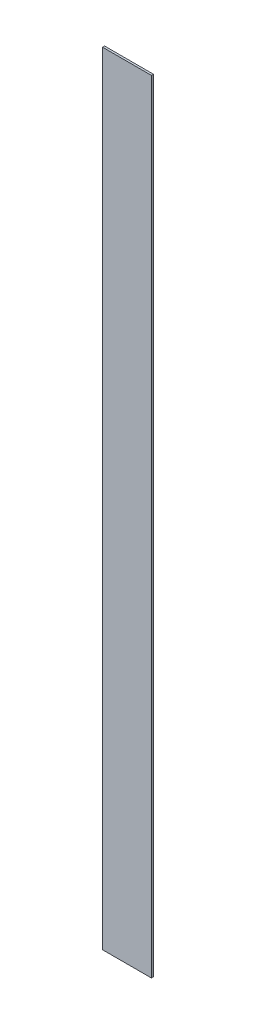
ISO-10303-21;
HEADER;
FILE_DESCRIPTION(('STEP AP214'),'2;1');
FILE_NAME('part.step','',(''),(''),'','','');
FILE_SCHEMA(('AUTOMOTIVE_DESIGN { 1 0 10303 214 1 1 1 1 }'));
ENDSEC;
DATA;
#1=APPLICATION_CONTEXT('core data for automotive mechanical design processes');
#2=APPLICATION_PROTOCOL_DEFINITION('international standard','automotive_design',2000,#1);
#3=PRODUCT_CONTEXT('',#1,'mechanical');
#4=PRODUCT('Part','Part','',(#3));
#5=PRODUCT_RELATED_PRODUCT_CATEGORY('part','',(#4));
#6=PRODUCT_DEFINITION_FORMATION('','',#4);
#7=PRODUCT_DEFINITION_CONTEXT('part definition',#1,'design');
#8=PRODUCT_DEFINITION('design','',#6,#7);
#9=PRODUCT_DEFINITION_SHAPE('','',#8);
#10=(LENGTH_UNIT() NAMED_UNIT(*) SI_UNIT(.MILLI.,.METRE.));
#11=(NAMED_UNIT(*) PLANE_ANGLE_UNIT() SI_UNIT($,.RADIAN.));
#12=(NAMED_UNIT(*) SI_UNIT($,.STERADIAN.) SOLID_ANGLE_UNIT());
#13=UNCERTAINTY_MEASURE_WITH_UNIT(LENGTH_MEASURE(1.E-05),#10,'distance_accuracy_value','');
#14=(GEOMETRIC_REPRESENTATION_CONTEXT(3) GLOBAL_UNCERTAINTY_ASSIGNED_CONTEXT((#13)) GLOBAL_UNIT_ASSIGNED_CONTEXT((#10,
#11,#12)) REPRESENTATION_CONTEXT('',''));
#15=CARTESIAN_POINT('',(0.,0.,0.));
#16=DIRECTION('',(0.,0.,1.));
#17=DIRECTION('',(1.,0.,0.));
#18=AXIS2_PLACEMENT_3D('',#15,#16,#17);
#19=CARTESIAN_POINT('',(-38.1,609.6,1.5875));
#20=DIRECTION('',(0.,-1.,0.));
#21=DIRECTION('',(0.,0.,-1.));
#22=AXIS2_PLACEMENT_3D('',#19,#20,#21);
#23=PLANE('',#22);
#24=DIRECTION('',(-1.,0.,0.));
#25=VECTOR('',#24,1.);
#26=CARTESIAN_POINT('',(-38.1,609.6,-1.5875));
#27=LINE('',#26,#25);
#28=CARTESIAN_POINT('',(38.1,609.6,-1.5875));
#29=VERTEX_POINT('',#28);
#30=CARTESIAN_POINT('',(-38.1,609.6,-1.5875));
#31=VERTEX_POINT('',#30);
#32=EDGE_CURVE('E111',#29,#31,#27,.T.);
#33=ORIENTED_EDGE('',*,*,#32,.T.);
#34=DIRECTION('',(0.,0.,-1.));
#35=VECTOR('',#34,1.);
#36=CARTESIAN_POINT('',(-38.1,609.6,1.5875));
#37=LINE('',#36,#35);
#38=CARTESIAN_POINT('',(-38.1,609.6,1.5875));
#39=VERTEX_POINT('',#38);
#40=EDGE_CURVE('E11',#39,#31,#37,.T.);
#41=ORIENTED_EDGE('',*,*,#40,.F.);
#42=DIRECTION('',(-1.,0.,0.));
#43=VECTOR('',#42,1.);
#44=CARTESIAN_POINT('',(-38.1,609.6,1.5875));
#45=LINE('',#44,#43);
#46=CARTESIAN_POINT('',(38.1,609.6,1.5875));
#47=VERTEX_POINT('',#46);
#48=EDGE_CURVE('E100',#47,#39,#45,.T.);
#49=ORIENTED_EDGE('',*,*,#48,.F.);
#50=DIRECTION('',(0.,0.,-1.));
#51=VECTOR('',#50,1.);
#52=CARTESIAN_POINT('',(38.1,609.6,1.5875));
#53=LINE('',#52,#51);
#54=EDGE_CURVE('E106',#47,#29,#53,.T.);
#55=ORIENTED_EDGE('',*,*,#54,.T.);
#56=EDGE_LOOP('',(#33,#41,#49,#55));
#57=FACE_BOUND('',#56,.T.);
#58=ADVANCED_FACE('F44',(#57),#23,.F.);
#59=CARTESIAN_POINT('',(-38.1,-609.6,1.5875));
#60=DIRECTION('',(1.,0.,0.));
#61=DIRECTION('',(0.,0.,-1.));
#62=AXIS2_PLACEMENT_3D('',#59,#60,#61);
#63=PLANE('',#62);
#64=DIRECTION('',(0.,-1.,0.));
#65=VECTOR('',#64,1.);
#66=CARTESIAN_POINT('',(-38.1,-609.6,-1.5875));
#67=LINE('',#66,#65);
#68=CARTESIAN_POINT('',(-38.1,-609.6,-1.5875));
#69=VERTEX_POINT('',#68);
#70=EDGE_CURVE('E105',#31,#69,#67,.T.);
#71=ORIENTED_EDGE('',*,*,#70,.T.);
#72=DIRECTION('',(0.,0.,-1.));
#73=VECTOR('',#72,1.);
#74=CARTESIAN_POINT('',(-38.1,-609.6,1.5875));
#75=LINE('',#74,#73);
#76=CARTESIAN_POINT('',(-38.1,-609.6,1.5875));
#77=VERTEX_POINT('',#76);
#78=EDGE_CURVE('E53',#77,#69,#75,.T.);
#79=ORIENTED_EDGE('',*,*,#78,.F.);
#80=DIRECTION('',(0.,-1.,0.));
#81=VECTOR('',#80,1.);
#82=CARTESIAN_POINT('',(-38.1,-609.6,1.5875));
#83=LINE('',#82,#81);
#84=EDGE_CURVE('E95',#39,#77,#83,.T.);
#85=ORIENTED_EDGE('',*,*,#84,.F.);
#86=ORIENTED_EDGE('',*,*,#40,.T.);
#87=EDGE_LOOP('',(#71,#79,#85,#86));
#88=FACE_BOUND('',#87,.T.);
#89=ADVANCED_FACE('F102',(#88),#63,.F.);
#90=CARTESIAN_POINT('',(-38.1,-609.6,1.5875));
#91=DIRECTION('',(0.,1.,0.));
#92=DIRECTION('',(-1.,0.,0.));
#93=AXIS2_PLACEMENT_3D('',#90,#91,#92);
#94=PLANE('',#93);
#95=DIRECTION('',(1.,0.,0.));
#96=VECTOR('',#95,1.);
#97=CARTESIAN_POINT('',(-38.1,-609.6,-1.5875));
#98=LINE('',#97,#96);
#99=CARTESIAN_POINT('',(38.1,-609.6,-1.5875));
#100=VERTEX_POINT('',#99);
#101=EDGE_CURVE('E80',#69,#100,#98,.T.);
#102=ORIENTED_EDGE('',*,*,#101,.T.);
#103=DIRECTION('',(0.,0.,-1.));
#104=VECTOR('',#103,1.);
#105=CARTESIAN_POINT('',(38.1,-609.6,1.5875));
#106=LINE('',#105,#104);
#107=CARTESIAN_POINT('',(38.1,-609.6,1.5875));
#108=VERTEX_POINT('',#107);
#109=EDGE_CURVE('E101',#108,#100,#106,.T.);
#110=ORIENTED_EDGE('',*,*,#109,.F.);
#111=DIRECTION('',(1.,0.,0.));
#112=VECTOR('',#111,1.);
#113=CARTESIAN_POINT('',(-38.1,-609.6,1.5875));
#114=LINE('',#113,#112);
#115=EDGE_CURVE('E94',#77,#108,#114,.T.);
#116=ORIENTED_EDGE('',*,*,#115,.F.);
#117=ORIENTED_EDGE('',*,*,#78,.T.);
#118=EDGE_LOOP('',(#102,#110,#116,#117));
#119=FACE_BOUND('',#118,.T.);
#120=ADVANCED_FACE('F103',(#119),#94,.F.);
#121=CARTESIAN_POINT('',(38.1,-609.6,1.5875));
#122=DIRECTION('',(-1.,0.,0.));
#123=DIRECTION('',(0.,0.,1.));
#124=AXIS2_PLACEMENT_3D('',#121,#122,#123);
#125=PLANE('',#124);
#126=DIRECTION('',(0.,1.,0.));
#127=VECTOR('',#126,1.);
#128=CARTESIAN_POINT('',(38.1,-609.6,-1.5875));
#129=LINE('',#128,#127);
#130=EDGE_CURVE('E82',#100,#29,#129,.T.);
#131=ORIENTED_EDGE('',*,*,#130,.T.);
#132=ORIENTED_EDGE('',*,*,#54,.F.);
#133=DIRECTION('',(0.,1.,0.));
#134=VECTOR('',#133,1.);
#135=CARTESIAN_POINT('',(38.1,-609.6,1.5875));
#136=LINE('',#135,#134);
#137=EDGE_CURVE('E64',#108,#47,#136,.T.);
#138=ORIENTED_EDGE('',*,*,#137,.F.);
#139=ORIENTED_EDGE('',*,*,#109,.T.);
#140=EDGE_LOOP('',(#131,#132,#138,#139));
#141=FACE_BOUND('',#140,.T.);
#142=ADVANCED_FACE('F128',(#141),#125,.F.);
#143=CARTESIAN_POINT('',(0.,0.,1.5875));
#144=DIRECTION('',(0.,0.,1.));
#145=DIRECTION('',(1.,0.,0.));
#146=AXIS2_PLACEMENT_3D('',#143,#144,#145);
#147=PLANE('',#146);
#148=ORIENTED_EDGE('',*,*,#48,.T.);
#149=ORIENTED_EDGE('',*,*,#84,.T.);
#150=ORIENTED_EDGE('',*,*,#115,.T.);
#151=ORIENTED_EDGE('',*,*,#137,.T.);
#152=EDGE_LOOP('',(#148,#149,#150,#151));
#153=FACE_BOUND('',#152,.T.);
#154=ADVANCED_FACE('F93',(#153),#147,.T.);
#155=CARTESIAN_POINT('',(0.,0.,-1.5875));
#156=DIRECTION('',(0.,0.,1.));
#157=DIRECTION('',(1.,0.,0.));
#158=AXIS2_PLACEMENT_3D('',#155,#156,#157);
#159=PLANE('',#158);
#160=ORIENTED_EDGE('',*,*,#32,.F.);
#161=ORIENTED_EDGE('',*,*,#130,.F.);
#162=ORIENTED_EDGE('',*,*,#101,.F.);
#163=ORIENTED_EDGE('',*,*,#70,.F.);
#164=EDGE_LOOP('',(#160,#161,#162,#163));
#165=FACE_BOUND('',#164,.T.);
#166=ADVANCED_FACE('F129',(#165),#159,.F.);
#167=CLOSED_SHELL('',(#58,#89,#120,#142,#154,#166));
#168=MANIFOLD_SOLID_BREP('B2',#167);
#169=ADVANCED_BREP_SHAPE_REPRESENTATION('',(#18,#168),#14);
#170=SHAPE_DEFINITION_REPRESENTATION(#9,#169);
ENDSEC;
END-ISO-10303-21;
